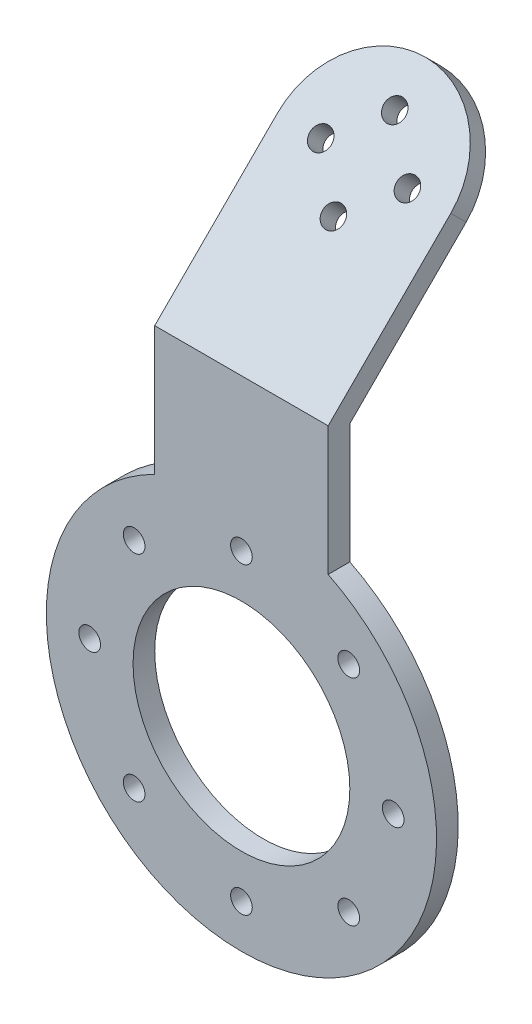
from build123d import *

# Parameters (mm, degrees)
SKETCH1_R         = 15.875
EXTRUDE1_DEPTH    = 3.175
EXTRUDE2_DEPTH    = 3.175
SKETCH3_R         = 1.5875
EXTRUDE3_DEPTH    = 83.249530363
CIRPATTERN1_COUNT = 8
SKETCH4_R         = 1.5875
EXTRUDE4_DEPTH    = 78.738955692
CIRPATTERN2_COUNT = 4


with BuildPart() as part:
    # Sketch1 → Extrude1 (new body)
    with BuildSketch(Plane.XY):
        with BuildLine():
            Line((-12.7, 25.597668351), (-12.7, 44.45))
            Line((-12.7, 44.45), (12.7, 44.45))
            Line((12.7, 44.45), (12.7, 25.597668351))
            ThreePointArc((12.7, 25.597668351), (0, -28.575), (-12.7, 25.597668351))
        make_face()
        Circle(SKETCH1_R, mode=Mode.SUBTRACT)
    extrude(amount=EXTRUDE1_DEPTH)

    # Sketch2 → Extrude2 (add)
    with BuildSketch(Plane(origin=(0, 23.8125, 23.8125), x_dir=(-1, 0, 0), z_dir=(0, 0.7071067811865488, 0.7071067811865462))):
        with BuildLine():
            Line((12.7, -29.185832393), (12.7, -54.585832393))
            ThreePointArc((12.7, -54.585832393), (0, -67.285832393), (-12.7, -54.585832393))
            Line((-12.7, -54.585832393), (-12.7, -29.185832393))
            Line((-12.7, -29.185832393), (12.7, -29.185832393))
        make_face()
    extrude(amount=-EXTRUDE2_DEPTH)

    # Sketch3 → Extrude3 (cut, through all)
    with BuildSketch(Plane.XY.offset(3.175)):
        with Locations((0, 22.225)):
            Circle(SKETCH3_R)
    extrude3 = extrude(amount=-EXTRUDE3_DEPTH, mode=Mode.SUBTRACT)

    # CirPattern1: Extrude3 ×8 about axis
    cirpattern1_axis = Axis((0, 0, 0), (0, 0, 1))
    for i in range(1, CIRPATTERN1_COUNT):
        add(extrude3.rotate(cirpattern1_axis, i * 360 / CIRPATTERN1_COUNT), mode=Mode.SUBTRACT)

    # Sketch4 → Extrude4 (cut, through all)
    with BuildSketch(Plane(origin=(0, 23.8125, 23.8125), x_dir=(1, 0, 0), z_dir=(0, 0.7071067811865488, 0.7071067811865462))):
        with Locations(Location((0, 60.935832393, 0), (0, 0, 270))):
            Circle(SKETCH4_R)
    extrude4 = extrude(amount=-EXTRUDE4_DEPTH, mode=Mode.SUBTRACT)

    # CirPattern2: Extrude4 ×4 about axis
    cirpattern2_axis = Axis((0, 38.598012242, -38.598012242), (0, 0.7071067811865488, 0.7071067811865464))
    for i in range(1, CIRPATTERN2_COUNT):
        add(extrude4.rotate(cirpattern2_axis, i * 360 / CIRPATTERN2_COUNT), mode=Mode.SUBTRACT)


solid = part.part
